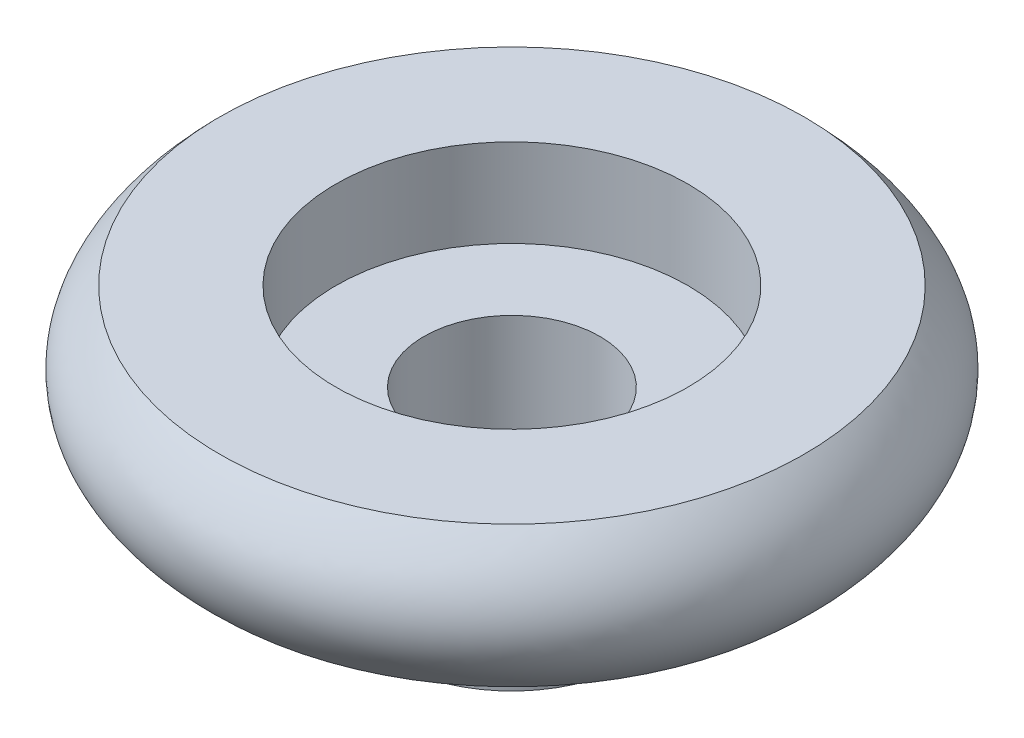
ISO-10303-21;
HEADER;
FILE_DESCRIPTION(('STEP AP214'),'2;1');
FILE_NAME('part.step','',(''),(''),'','','');
FILE_SCHEMA(('AUTOMOTIVE_DESIGN { 1 0 10303 214 1 1 1 1 }'));
ENDSEC;
DATA;
#1=APPLICATION_CONTEXT('core data for automotive mechanical design processes');
#2=APPLICATION_PROTOCOL_DEFINITION('international standard','automotive_design',2000,#1);
#3=PRODUCT_CONTEXT('',#1,'mechanical');
#4=PRODUCT('Part','Part','',(#3));
#5=PRODUCT_RELATED_PRODUCT_CATEGORY('part','',(#4));
#6=PRODUCT_DEFINITION_FORMATION('','',#4);
#7=PRODUCT_DEFINITION_CONTEXT('part definition',#1,'design');
#8=PRODUCT_DEFINITION('design','',#6,#7);
#9=PRODUCT_DEFINITION_SHAPE('','',#8);
#10=(LENGTH_UNIT() NAMED_UNIT(*) SI_UNIT(.MILLI.,.METRE.));
#11=(NAMED_UNIT(*) PLANE_ANGLE_UNIT() SI_UNIT($,.RADIAN.));
#12=(NAMED_UNIT(*) SI_UNIT($,.STERADIAN.) SOLID_ANGLE_UNIT());
#13=UNCERTAINTY_MEASURE_WITH_UNIT(LENGTH_MEASURE(1.E-05),#10,'distance_accuracy_value','');
#14=(GEOMETRIC_REPRESENTATION_CONTEXT(3) GLOBAL_UNCERTAINTY_ASSIGNED_CONTEXT((#13)) GLOBAL_UNIT_ASSIGNED_CONTEXT((#10,
#11,#12)) REPRESENTATION_CONTEXT('',''));
#15=CARTESIAN_POINT('',(0.,0.,0.));
#16=DIRECTION('',(0.,0.,1.));
#17=DIRECTION('',(1.,0.,0.));
#18=AXIS2_PLACEMENT_3D('',#15,#16,#17);
#19=CARTESIAN_POINT('',(2.5,0.442351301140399,0.));
#20=DIRECTION('',(0.,-1.,0.));
#21=DIRECTION('',(0.,0.,-1.));
#22=AXIS2_PLACEMENT_3D('',#19,#20,#21);
#23=PLANE('',#22);
#24=CARTESIAN_POINT('',(0.,0.442351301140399,0.));
#25=DIRECTION('',(0.,-1.,0.));
#26=DIRECTION('',(0.,0.,-1.));
#27=AXIS2_PLACEMENT_3D('',#24,#25,#26);
#28=CIRCLE('',#27,3.5);
#29=CARTESIAN_POINT('',(0.,0.442351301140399,-3.5));
#30=VERTEX_POINT('',#29);
#31=EDGE_CURVE('E10',#30,#30,#28,.T.);
#32=ORIENTED_EDGE('',*,*,#31,.T.);
#33=EDGE_LOOP('',(#32));
#34=FACE_BOUND('',#33,.T.);
#35=CARTESIAN_POINT('',(0.,0.442351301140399,0.));
#36=DIRECTION('',(0.,-1.,0.));
#37=DIRECTION('',(0.,0.,-1.));
#38=AXIS2_PLACEMENT_3D('',#35,#36,#37);
#39=CIRCLE('',#38,2.5);
#40=CARTESIAN_POINT('',(0.,0.442351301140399,-2.5));
#41=VERTEX_POINT('',#40);
#42=EDGE_CURVE('E74',#41,#41,#39,.T.);
#43=ORIENTED_EDGE('',*,*,#42,.F.);
#44=EDGE_LOOP('',(#43));
#45=FACE_BOUND('',#44,.T.);
#46=ADVANCED_FACE('F40',(#34,#45),#23,.T.);
#47=CARTESIAN_POINT('',(0.,0.,0.));
#48=DIRECTION('',(0.,-1.,0.));
#49=DIRECTION('',(0.,0.,-1.));
#50=AXIS2_PLACEMENT_3D('',#47,#48,#49);
#51=CYLINDRICAL_SURFACE('',#50,3.5);
#52=CARTESIAN_POINT('',(0.,3.4423513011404,0.));
#53=DIRECTION('',(0.,-1.,0.));
#54=DIRECTION('',(0.,0.,-1.));
#55=AXIS2_PLACEMENT_3D('',#52,#53,#54);
#56=CIRCLE('',#55,3.5);
#57=CARTESIAN_POINT('',(0.,3.4423513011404,-3.5));
#58=VERTEX_POINT('',#57);
#59=EDGE_CURVE('E43',#58,#58,#56,.T.);
#60=ORIENTED_EDGE('',*,*,#59,.T.);
#61=EDGE_LOOP('',(#60));
#62=FACE_BOUND('',#61,.T.);
#63=ORIENTED_EDGE('',*,*,#31,.F.);
#64=EDGE_LOOP('',(#63));
#65=FACE_BOUND('',#64,.T.);
#66=ADVANCED_FACE('F104',(#62,#65),#51,.T.);
#67=CARTESIAN_POINT('',(5.,3.4423513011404,0.));
#68=DIRECTION('',(0.,-1.,0.));
#69=DIRECTION('',(0.,0.,-1.));
#70=AXIS2_PLACEMENT_3D('',#67,#68,#69);
#71=PLANE('',#70);
#72=CARTESIAN_POINT('',(0.,3.4423513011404,0.));
#73=DIRECTION('',(0.,-1.,0.));
#74=DIRECTION('',(0.,0.,-1.));
#75=AXIS2_PLACEMENT_3D('',#72,#73,#74);
#76=CIRCLE('',#75,5.);
#77=CARTESIAN_POINT('',(0.,3.4423513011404,-5.));
#78=VERTEX_POINT('',#77);
#79=EDGE_CURVE('E50',#78,#78,#76,.T.);
#80=ORIENTED_EDGE('',*,*,#79,.T.);
#81=EDGE_LOOP('',(#80));
#82=FACE_BOUND('',#81,.T.);
#83=ORIENTED_EDGE('',*,*,#59,.F.);
#84=EDGE_LOOP('',(#83));
#85=FACE_BOUND('',#84,.T.);
#86=ADVANCED_FACE('F105',(#82,#85),#71,.T.);
#87=CARTESIAN_POINT('',(0.,0.,0.));
#88=DIRECTION('',(0.,-1.,0.));
#89=DIRECTION('',(0.,0.,-1.));
#90=AXIS2_PLACEMENT_3D('',#87,#88,#89);
#91=CYLINDRICAL_SURFACE('',#90,5.);
#92=CARTESIAN_POINT('',(0.,4.4423513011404,0.));
#93=DIRECTION('',(0.,-1.,0.));
#94=DIRECTION('',(0.,0.,-1.));
#95=AXIS2_PLACEMENT_3D('',#92,#93,#94);
#96=CIRCLE('',#95,5.);
#97=CARTESIAN_POINT('',(0.,4.4423513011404,-5.));
#98=VERTEX_POINT('',#97);
#99=EDGE_CURVE('E51',#98,#98,#96,.T.);
#100=ORIENTED_EDGE('',*,*,#99,.T.);
#101=EDGE_LOOP('',(#100));
#102=FACE_BOUND('',#101,.T.);
#103=ORIENTED_EDGE('',*,*,#79,.F.);
#104=EDGE_LOOP('',(#103));
#105=FACE_BOUND('',#104,.T.);
#106=ADVANCED_FACE('F98',(#102,#105),#91,.T.);
#107=CARTESIAN_POINT('',(8.3,4.4423513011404,0.));
#108=DIRECTION('',(0.,-1.,0.));
#109=DIRECTION('',(0.,0.,-1.));
#110=AXIS2_PLACEMENT_3D('',#107,#108,#109);
#111=PLANE('',#110);
#112=CARTESIAN_POINT('',(0.,4.4423513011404,0.));
#113=DIRECTION('',(0.,-1.,0.));
#114=DIRECTION('',(0.,0.,-1.));
#115=AXIS2_PLACEMENT_3D('',#112,#113,#114);
#116=CIRCLE('',#115,8.3);
#117=CARTESIAN_POINT('',(0.,4.4423513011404,-8.3));
#118=VERTEX_POINT('',#117);
#119=EDGE_CURVE('E57',#118,#118,#116,.T.);
#120=ORIENTED_EDGE('',*,*,#119,.T.);
#121=EDGE_LOOP('',(#120));
#122=FACE_BOUND('',#121,.T.);
#123=ORIENTED_EDGE('',*,*,#99,.F.);
#124=EDGE_LOOP('',(#123));
#125=FACE_BOUND('',#124,.T.);
#126=ADVANCED_FACE('F94',(#122,#125),#111,.T.);
#127=CARTESIAN_POINT('',(0.,0.,0.));
#128=DIRECTION('',(0.,-1.,0.));
#129=DIRECTION('',(0.,0.,-1.));
#130=AXIS2_PLACEMENT_3D('',#127,#128,#129);
#131=CYLINDRICAL_SURFACE('',#130,8.3);
#132=CARTESIAN_POINT('',(0.,3.9423513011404,0.));
#133=DIRECTION('',(0.,-1.,0.));
#134=DIRECTION('',(0.,0.,-1.));
#135=AXIS2_PLACEMENT_3D('',#132,#133,#134);
#136=CIRCLE('',#135,8.3);
#137=CARTESIAN_POINT('',(0.,3.9423513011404,-8.3));
#138=VERTEX_POINT('',#137);
#139=EDGE_CURVE('E56',#138,#138,#136,.T.);
#140=ORIENTED_EDGE('',*,*,#139,.T.);
#141=EDGE_LOOP('',(#140));
#142=FACE_BOUND('',#141,.T.);
#143=ORIENTED_EDGE('',*,*,#119,.F.);
#144=EDGE_LOOP('',(#143));
#145=FACE_BOUND('',#144,.T.);
#146=ADVANCED_FACE('F90',(#142,#145),#131,.F.);
#147=CARTESIAN_POINT('',(8.3,3.9423513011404,0.));
#148=CARTESIAN_POINT('',(10.4224068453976,5.82629466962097,0.));
#149=CARTESIAN_POINT('',(8.3,7.9423513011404,0.));
#150=B_SPLINE_CURVE_WITH_KNOTS('',2,(#147,#148,#149),.UNSPECIFIED.,.F.,.F.,(3,3),(0.,1.),.UNSPECIFIED.);
#151=CARTESIAN_POINT('',(0.,0.,0.));
#152=DIRECTION('',(0.,-1.,0.));
#153=AXIS1_PLACEMENT('',#151,#152);
#154=SURFACE_OF_REVOLUTION('',#150,#153);
#155=CARTESIAN_POINT('',(0.,7.9423513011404,0.));
#156=DIRECTION('',(0.,-1.,0.));
#157=DIRECTION('',(0.,0.,-1.));
#158=AXIS2_PLACEMENT_3D('',#155,#156,#157);
#159=CIRCLE('',#158,8.3);
#160=CARTESIAN_POINT('',(0.,7.9423513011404,-8.3));
#161=VERTEX_POINT('',#160);
#162=EDGE_CURVE('E64',#161,#161,#159,.T.);
#163=ORIENTED_EDGE('',*,*,#162,.T.);
#164=EDGE_LOOP('',(#163));
#165=FACE_BOUND('',#164,.T.);
#166=ORIENTED_EDGE('',*,*,#139,.F.);
#167=EDGE_LOOP('',(#166));
#168=FACE_BOUND('',#167,.T.);
#169=ADVANCED_FACE('F83',(#165,#168),#154,.F.);
#170=CARTESIAN_POINT('',(8.3,7.9423513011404,0.));
#171=DIRECTION('',(0.,1.,0.));
#172=DIRECTION('',(0.,0.,1.));
#173=AXIS2_PLACEMENT_3D('',#170,#171,#172);
#174=PLANE('',#173);
#175=CARTESIAN_POINT('',(0.,7.9423513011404,0.));
#176=DIRECTION('',(0.,-1.,0.));
#177=DIRECTION('',(0.,0.,-1.));
#178=AXIS2_PLACEMENT_3D('',#175,#176,#177);
#179=CIRCLE('',#178,5.);
#180=CARTESIAN_POINT('',(0.,7.9423513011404,-5.));
#181=VERTEX_POINT('',#180);
#182=EDGE_CURVE('E61',#181,#181,#179,.T.);
#183=ORIENTED_EDGE('',*,*,#182,.T.);
#184=EDGE_LOOP('',(#183));
#185=FACE_BOUND('',#184,.T.);
#186=ORIENTED_EDGE('',*,*,#162,.F.);
#187=EDGE_LOOP('',(#186));
#188=FACE_BOUND('',#187,.T.);
#189=ADVANCED_FACE('F86',(#185,#188),#174,.T.);
#190=CARTESIAN_POINT('',(0.,0.,0.));
#191=DIRECTION('',(0.,-1.,0.));
#192=DIRECTION('',(0.,0.,-1.));
#193=AXIS2_PLACEMENT_3D('',#190,#191,#192);
#194=CYLINDRICAL_SURFACE('',#193,5.);
#195=CARTESIAN_POINT('',(0.,5.4423513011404,0.));
#196=DIRECTION('',(0.,-1.,0.));
#197=DIRECTION('',(0.,0.,-1.));
#198=AXIS2_PLACEMENT_3D('',#195,#196,#197);
#199=CIRCLE('',#198,5.);
#200=CARTESIAN_POINT('',(0.,5.4423513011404,-5.));
#201=VERTEX_POINT('',#200);
#202=EDGE_CURVE('E70',#201,#201,#199,.T.);
#203=ORIENTED_EDGE('',*,*,#202,.T.);
#204=EDGE_LOOP('',(#203));
#205=FACE_BOUND('',#204,.T.);
#206=ORIENTED_EDGE('',*,*,#182,.F.);
#207=EDGE_LOOP('',(#206));
#208=FACE_BOUND('',#207,.T.);
#209=ADVANCED_FACE('F127',(#205,#208),#194,.F.);
#210=CARTESIAN_POINT('',(5.,5.4423513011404,0.));
#211=DIRECTION('',(0.,1.,0.));
#212=DIRECTION('',(0.,0.,1.));
#213=AXIS2_PLACEMENT_3D('',#210,#211,#212);
#214=PLANE('',#213);
#215=CARTESIAN_POINT('',(0.,5.4423513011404,0.));
#216=DIRECTION('',(0.,-1.,0.));
#217=DIRECTION('',(0.,0.,-1.));
#218=AXIS2_PLACEMENT_3D('',#215,#216,#217);
#219=CIRCLE('',#218,2.5);
#220=CARTESIAN_POINT('',(0.,5.4423513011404,-2.5));
#221=VERTEX_POINT('',#220);
#222=EDGE_CURVE('E72',#221,#221,#219,.T.);
#223=ORIENTED_EDGE('',*,*,#222,.T.);
#224=EDGE_LOOP('',(#223));
#225=FACE_BOUND('',#224,.T.);
#226=ORIENTED_EDGE('',*,*,#202,.F.);
#227=EDGE_LOOP('',(#226));
#228=FACE_BOUND('',#227,.T.);
#229=ADVANCED_FACE('F116',(#225,#228),#214,.T.);
#230=CARTESIAN_POINT('',(0.,0.,0.));
#231=DIRECTION('',(0.,-1.,0.));
#232=DIRECTION('',(0.,0.,-1.));
#233=AXIS2_PLACEMENT_3D('',#230,#231,#232);
#234=CYLINDRICAL_SURFACE('',#233,2.5);
#235=ORIENTED_EDGE('',*,*,#42,.T.);
#236=EDGE_LOOP('',(#235));
#237=FACE_BOUND('',#236,.T.);
#238=ORIENTED_EDGE('',*,*,#222,.F.);
#239=EDGE_LOOP('',(#238));
#240=FACE_BOUND('',#239,.T.);
#241=ADVANCED_FACE('F119',(#237,#240),#234,.F.);
#242=CLOSED_SHELL('',(#46,#66,#86,#106,#126,#146,#169,#189,#209,#229,#241));
#243=MANIFOLD_SOLID_BREP('B2',#242);
#244=ADVANCED_BREP_SHAPE_REPRESENTATION('',(#18,#243),#14);
#245=SHAPE_DEFINITION_REPRESENTATION(#9,#244);
ENDSEC;
END-ISO-10303-21;
